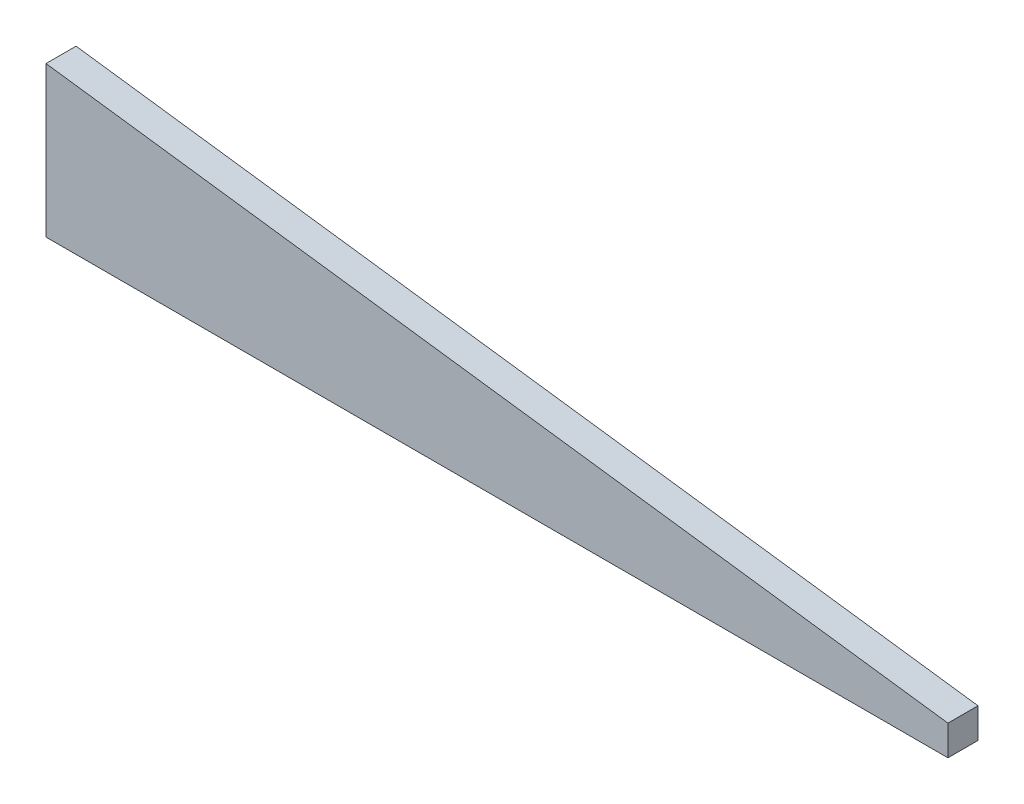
ISO-10303-21;
HEADER;
FILE_DESCRIPTION(('STEP AP214'),'2;1');
FILE_NAME('part.step','',(''),(''),'','','');
FILE_SCHEMA(('AUTOMOTIVE_DESIGN { 1 0 10303 214 1 1 1 1 }'));
ENDSEC;
DATA;
#1=APPLICATION_CONTEXT('core data for automotive mechanical design processes');
#2=APPLICATION_PROTOCOL_DEFINITION('international standard','automotive_design',2000,#1);
#3=PRODUCT_CONTEXT('',#1,'mechanical');
#4=PRODUCT('Part','Part','',(#3));
#5=PRODUCT_RELATED_PRODUCT_CATEGORY('part','',(#4));
#6=PRODUCT_DEFINITION_FORMATION('','',#4);
#7=PRODUCT_DEFINITION_CONTEXT('part definition',#1,'design');
#8=PRODUCT_DEFINITION('design','',#6,#7);
#9=PRODUCT_DEFINITION_SHAPE('','',#8);
#10=(LENGTH_UNIT() NAMED_UNIT(*) SI_UNIT(.MILLI.,.METRE.));
#11=(NAMED_UNIT(*) PLANE_ANGLE_UNIT() SI_UNIT($,.RADIAN.));
#12=(NAMED_UNIT(*) SI_UNIT($,.STERADIAN.) SOLID_ANGLE_UNIT());
#13=UNCERTAINTY_MEASURE_WITH_UNIT(LENGTH_MEASURE(1.E-05),#10,'distance_accuracy_value','');
#14=(GEOMETRIC_REPRESENTATION_CONTEXT(3) GLOBAL_UNCERTAINTY_ASSIGNED_CONTEXT((#13)) GLOBAL_UNIT_ASSIGNED_CONTEXT((#10,
#11,#12)) REPRESENTATION_CONTEXT('',''));
#15=CARTESIAN_POINT('',(0.,0.,0.));
#16=DIRECTION('',(0.,0.,1.));
#17=DIRECTION('',(1.,0.,0.));
#18=AXIS2_PLACEMENT_3D('',#15,#16,#17);
#19=CARTESIAN_POINT('',(0.,50.,10.));
#20=DIRECTION('',(1.,0.,0.));
#21=DIRECTION('',(0.,1.,0.));
#22=AXIS2_PLACEMENT_3D('',#19,#20,#21);
#23=PLANE('',#22);
#24=DIRECTION('',(0.,-1.,0.));
#25=VECTOR('',#24,1.);
#26=CARTESIAN_POINT('',(0.,50.,0.));
#27=LINE('',#26,#25);
#28=CARTESIAN_POINT('',(0.,50.,0.));
#29=VERTEX_POINT('',#28);
#30=CARTESIAN_POINT('',(0.,0.,0.));
#31=VERTEX_POINT('',#30);
#32=EDGE_CURVE('E99',#29,#31,#27,.T.);
#33=ORIENTED_EDGE('',*,*,#32,.T.);
#34=DIRECTION('',(0.,0.,-1.));
#35=VECTOR('',#34,1.);
#36=CARTESIAN_POINT('',(0.,0.,10.));
#37=LINE('',#36,#35);
#38=CARTESIAN_POINT('',(0.,0.,10.));
#39=VERTEX_POINT('',#38);
#40=EDGE_CURVE('E11',#39,#31,#37,.T.);
#41=ORIENTED_EDGE('',*,*,#40,.F.);
#42=DIRECTION('',(0.,-1.,0.));
#43=VECTOR('',#42,1.);
#44=CARTESIAN_POINT('',(0.,50.,10.));
#45=LINE('',#44,#43);
#46=CARTESIAN_POINT('',(0.,50.,10.));
#47=VERTEX_POINT('',#46);
#48=EDGE_CURVE('E87',#47,#39,#45,.T.);
#49=ORIENTED_EDGE('',*,*,#48,.F.);
#50=DIRECTION('',(0.,0.,-1.));
#51=VECTOR('',#50,1.);
#52=CARTESIAN_POINT('',(0.,50.,10.));
#53=LINE('',#52,#51);
#54=EDGE_CURVE('E95',#47,#29,#53,.T.);
#55=ORIENTED_EDGE('',*,*,#54,.T.);
#56=EDGE_LOOP('',(#33,#41,#49,#55));
#57=FACE_BOUND('',#56,.T.);
#58=ADVANCED_FACE('F36',(#57),#23,.F.);
#59=CARTESIAN_POINT('',(0.,0.,10.));
#60=DIRECTION('',(0.,1.,0.));
#61=DIRECTION('',(0.,0.,1.));
#62=AXIS2_PLACEMENT_3D('',#59,#60,#61);
#63=PLANE('',#62);
#64=DIRECTION('',(1.,0.,0.));
#65=VECTOR('',#64,1.);
#66=CARTESIAN_POINT('',(0.,0.,0.));
#67=LINE('',#66,#65);
#68=CARTESIAN_POINT('',(300.,0.,0.));
#69=VERTEX_POINT('',#68);
#70=EDGE_CURVE('E91',#31,#69,#67,.T.);
#71=ORIENTED_EDGE('',*,*,#70,.T.);
#72=DIRECTION('',(0.,0.,-1.));
#73=VECTOR('',#72,1.);
#74=CARTESIAN_POINT('',(300.,0.,10.));
#75=LINE('',#74,#73);
#76=CARTESIAN_POINT('',(300.,0.,10.));
#77=VERTEX_POINT('',#76);
#78=EDGE_CURVE('E44',#77,#69,#75,.T.);
#79=ORIENTED_EDGE('',*,*,#78,.F.);
#80=DIRECTION('',(1.,0.,0.));
#81=VECTOR('',#80,1.);
#82=CARTESIAN_POINT('',(0.,0.,10.));
#83=LINE('',#82,#81);
#84=EDGE_CURVE('E82',#39,#77,#83,.T.);
#85=ORIENTED_EDGE('',*,*,#84,.F.);
#86=ORIENTED_EDGE('',*,*,#40,.T.);
#87=EDGE_LOOP('',(#71,#79,#85,#86));
#88=FACE_BOUND('',#87,.T.);
#89=ADVANCED_FACE('F90',(#88),#63,.F.);
#90=CARTESIAN_POINT('',(300.,0.,10.));
#91=DIRECTION('',(-1.,0.,0.));
#92=DIRECTION('',(0.,0.,1.));
#93=AXIS2_PLACEMENT_3D('',#90,#91,#92);
#94=PLANE('',#93);
#95=DIRECTION('',(0.,1.,0.));
#96=VECTOR('',#95,1.);
#97=CARTESIAN_POINT('',(300.,0.,0.));
#98=LINE('',#97,#96);
#99=CARTESIAN_POINT('',(300.,10.,0.));
#100=VERTEX_POINT('',#99);
#101=EDGE_CURVE('E69',#69,#100,#98,.T.);
#102=ORIENTED_EDGE('',*,*,#101,.T.);
#103=DIRECTION('',(0.,0.,-1.));
#104=VECTOR('',#103,1.);
#105=CARTESIAN_POINT('',(300.,10.,10.));
#106=LINE('',#105,#104);
#107=CARTESIAN_POINT('',(300.,10.,10.));
#108=VERTEX_POINT('',#107);
#109=EDGE_CURVE('E92',#108,#100,#106,.T.);
#110=ORIENTED_EDGE('',*,*,#109,.F.);
#111=DIRECTION('',(0.,1.,0.));
#112=VECTOR('',#111,1.);
#113=CARTESIAN_POINT('',(300.,0.,10.));
#114=LINE('',#113,#112);
#115=EDGE_CURVE('E85',#77,#108,#114,.T.);
#116=ORIENTED_EDGE('',*,*,#115,.F.);
#117=ORIENTED_EDGE('',*,*,#78,.T.);
#118=EDGE_LOOP('',(#102,#110,#116,#117));
#119=FACE_BOUND('',#118,.T.);
#120=ADVANCED_FACE('F93',(#119),#94,.F.);
#121=CARTESIAN_POINT('',(300.,10.,10.));
#122=DIRECTION('',(-0.132163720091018,-0.991227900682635,0.));
#123=DIRECTION('',(0.991227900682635,-0.132163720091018,0.));
#124=AXIS2_PLACEMENT_3D('',#121,#122,#123);
#125=PLANE('',#124);
#126=DIRECTION('',(-0.991227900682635,0.132163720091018,0.));
#127=VECTOR('',#126,1.);
#128=CARTESIAN_POINT('',(300.,10.,0.));
#129=LINE('',#128,#127);
#130=EDGE_CURVE('E75',#100,#29,#129,.T.);
#131=ORIENTED_EDGE('',*,*,#130,.T.);
#132=ORIENTED_EDGE('',*,*,#54,.F.);
#133=DIRECTION('',(-0.991227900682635,0.132163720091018,0.));
#134=VECTOR('',#133,1.);
#135=CARTESIAN_POINT('',(300.,10.,10.));
#136=LINE('',#135,#134);
#137=EDGE_CURVE('E52',#108,#47,#136,.T.);
#138=ORIENTED_EDGE('',*,*,#137,.F.);
#139=ORIENTED_EDGE('',*,*,#109,.T.);
#140=EDGE_LOOP('',(#131,#132,#138,#139));
#141=FACE_BOUND('',#140,.T.);
#142=ADVANCED_FACE('F106',(#141),#125,.F.);
#143=CARTESIAN_POINT('',(0.,0.,10.));
#144=DIRECTION('',(0.,0.,1.));
#145=DIRECTION('',(1.,0.,0.));
#146=AXIS2_PLACEMENT_3D('',#143,#144,#145);
#147=PLANE('',#146);
#148=ORIENTED_EDGE('',*,*,#48,.T.);
#149=ORIENTED_EDGE('',*,*,#84,.T.);
#150=ORIENTED_EDGE('',*,*,#115,.T.);
#151=ORIENTED_EDGE('',*,*,#137,.T.);
#152=EDGE_LOOP('',(#148,#149,#150,#151));
#153=FACE_BOUND('',#152,.T.);
#154=ADVANCED_FACE('F83',(#153),#147,.T.);
#155=CARTESIAN_POINT('',(0.,0.,0.));
#156=DIRECTION('',(0.,0.,1.));
#157=DIRECTION('',(1.,0.,0.));
#158=AXIS2_PLACEMENT_3D('',#155,#156,#157);
#159=PLANE('',#158);
#160=ORIENTED_EDGE('',*,*,#32,.F.);
#161=ORIENTED_EDGE('',*,*,#130,.F.);
#162=ORIENTED_EDGE('',*,*,#101,.F.);
#163=ORIENTED_EDGE('',*,*,#70,.F.);
#164=EDGE_LOOP('',(#160,#161,#162,#163));
#165=FACE_BOUND('',#164,.T.);
#166=ADVANCED_FACE('F109',(#165),#159,.F.);
#167=CLOSED_SHELL('',(#58,#89,#120,#142,#154,#166));
#168=MANIFOLD_SOLID_BREP('B2',#167);
#169=ADVANCED_BREP_SHAPE_REPRESENTATION('',(#18,#168),#14);
#170=SHAPE_DEFINITION_REPRESENTATION(#9,#169);
ENDSEC;
END-ISO-10303-21;
